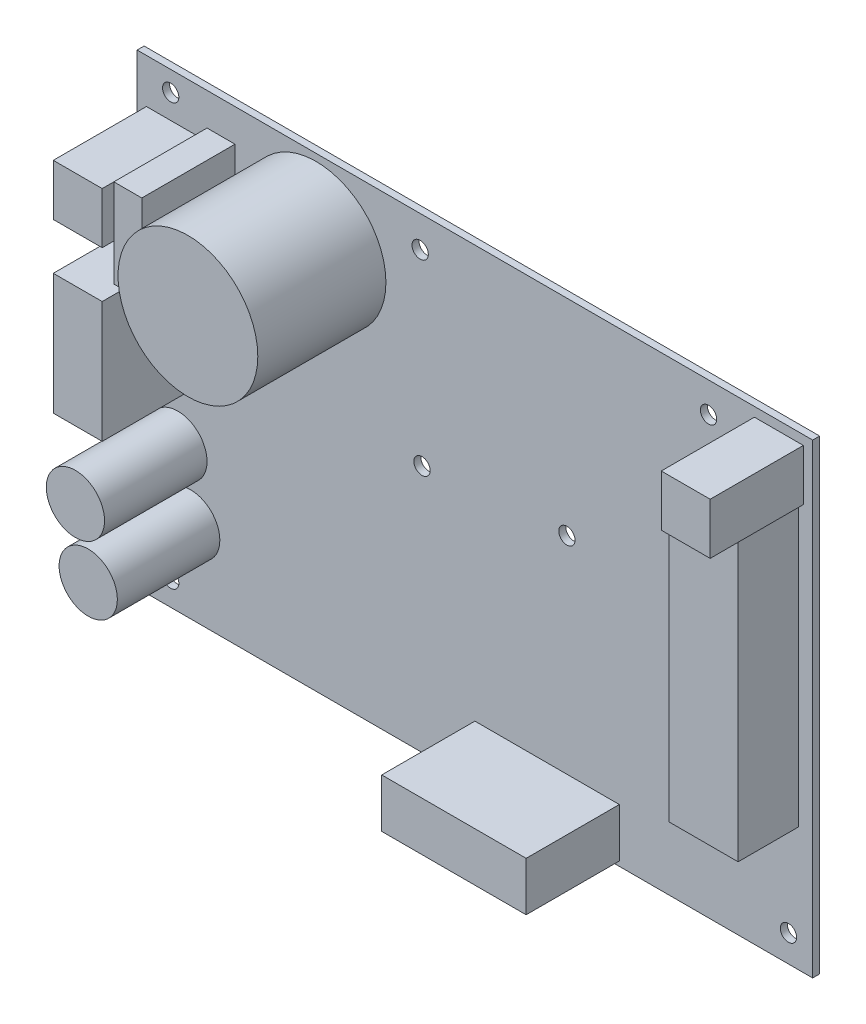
ISO-10303-21;
HEADER;
FILE_DESCRIPTION(('STEP AP214'),'2;1');
FILE_NAME('part.step','',(''),(''),'','','');
FILE_SCHEMA(('AUTOMOTIVE_DESIGN { 1 0 10303 214 1 1 1 1 }'));
ENDSEC;
DATA;
#1=APPLICATION_CONTEXT('core data for automotive mechanical design processes');
#2=APPLICATION_PROTOCOL_DEFINITION('international standard','automotive_design',2000,#1);
#3=PRODUCT_CONTEXT('',#1,'mechanical');
#4=PRODUCT('Part','Part','',(#3));
#5=PRODUCT_RELATED_PRODUCT_CATEGORY('part','',(#4));
#6=PRODUCT_DEFINITION_FORMATION('','',#4);
#7=PRODUCT_DEFINITION_CONTEXT('part definition',#1,'design');
#8=PRODUCT_DEFINITION('design','',#6,#7);
#9=PRODUCT_DEFINITION_SHAPE('','',#8);
#10=(LENGTH_UNIT() NAMED_UNIT(*) SI_UNIT(.MILLI.,.METRE.));
#11=(NAMED_UNIT(*) PLANE_ANGLE_UNIT() SI_UNIT($,.RADIAN.));
#12=(NAMED_UNIT(*) SI_UNIT($,.STERADIAN.) SOLID_ANGLE_UNIT());
#13=UNCERTAINTY_MEASURE_WITH_UNIT(LENGTH_MEASURE(1.E-05),#10,'distance_accuracy_value','');
#14=(GEOMETRIC_REPRESENTATION_CONTEXT(3) GLOBAL_UNCERTAINTY_ASSIGNED_CONTEXT((#13)) GLOBAL_UNIT_ASSIGNED_CONTEXT((#10,
#11,#12)) REPRESENTATION_CONTEXT('',''));
#15=CARTESIAN_POINT('',(0.,0.,0.));
#16=DIRECTION('',(0.,0.,1.));
#17=DIRECTION('',(1.,0.,0.));
#18=AXIS2_PLACEMENT_3D('',#15,#16,#17);
#19=CARTESIAN_POINT('',(-31.5892523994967,-18.7964158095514,23.5));
#20=DIRECTION('',(0.,0.,-1.));
#21=DIRECTION('',(-1.,0.,0.));
#22=AXIS2_PLACEMENT_3D('',#19,#20,#21);
#23=CYLINDRICAL_SURFACE('',#22,6.25);
#24=CARTESIAN_POINT('',(-31.5892523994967,-18.7964158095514,23.5));
#25=DIRECTION('',(0.,0.,1.));
#26=DIRECTION('',(1.,0.,0.));
#27=AXIS2_PLACEMENT_3D('',#24,#25,#26);
#28=CIRCLE('',#27,6.25);
#29=CARTESIAN_POINT('',(-25.3392523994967,-18.7964158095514,23.5));
#30=VERTEX_POINT('',#29);
#31=EDGE_CURVE('E13',#30,#30,#28,.T.);
#32=ORIENTED_EDGE('',*,*,#31,.F.);
#33=EDGE_LOOP('',(#32));
#34=FACE_BOUND('',#33,.T.);
#35=CARTESIAN_POINT('',(-31.5892523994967,-18.7964158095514,1.5));
#36=DIRECTION('',(0.,0.,1.));
#37=DIRECTION('',(1.,0.,0.));
#38=AXIS2_PLACEMENT_3D('',#35,#36,#37);
#39=CIRCLE('',#38,6.25);
#40=CARTESIAN_POINT('',(-25.3392523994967,-18.7964158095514,1.5));
#41=VERTEX_POINT('',#40);
#42=EDGE_CURVE('E61',#41,#41,#39,.T.);
#43=ORIENTED_EDGE('',*,*,#42,.T.);
#44=EDGE_LOOP('',(#43));
#45=FACE_BOUND('',#44,.T.);
#46=ADVANCED_FACE('F58',(#34,#45),#23,.T.);
#47=CARTESIAN_POINT('',(-31.5892523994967,-18.7964158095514,23.5));
#48=DIRECTION('',(0.,0.,1.));
#49=DIRECTION('',(1.,0.,0.));
#50=AXIS2_PLACEMENT_3D('',#47,#48,#49);
#51=PLANE('',#50);
#52=ORIENTED_EDGE('',*,*,#31,.T.);
#53=EDGE_LOOP('',(#52));
#54=FACE_BOUND('',#53,.T.);
#55=ADVANCED_FACE('F73',(#54),#51,.T.);
#56=CARTESIAN_POINT('',(-31.5892523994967,-18.7964158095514,1.5));
#57=DIRECTION('',(0.,0.,1.));
#58=DIRECTION('',(1.,0.,0.));
#59=AXIS2_PLACEMENT_3D('',#56,#57,#58);
#60=PLANE('',#59);
#61=ORIENTED_EDGE('',*,*,#42,.F.);
#62=EDGE_LOOP('',(#61));
#63=FACE_BOUND('',#62,.T.);
#64=ADVANCED_FACE('F71',(#63),#60,.F.);
#65=CLOSED_SHELL('',(#46,#55,#64));
#66=MANIFOLD_SOLID_BREP('B2',#65);
#67=CARTESIAN_POINT('',(-34.3392523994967,-5.5464158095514,23.5));
#68=DIRECTION('',(0.,0.,-1.));
#69=DIRECTION('',(-1.,0.,0.));
#70=AXIS2_PLACEMENT_3D('',#67,#68,#69);
#71=CYLINDRICAL_SURFACE('',#70,6.25);
#72=CARTESIAN_POINT('',(-34.3392523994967,-5.5464158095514,23.5));
#73=DIRECTION('',(0.,0.,1.));
#74=DIRECTION('',(1.,0.,0.));
#75=AXIS2_PLACEMENT_3D('',#72,#73,#74);
#76=CIRCLE('',#75,6.25);
#77=CARTESIAN_POINT('',(-28.0892523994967,-5.5464158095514,23.5));
#78=VERTEX_POINT('',#77);
#79=EDGE_CURVE('E57',#78,#78,#76,.T.);
#80=ORIENTED_EDGE('',*,*,#79,.F.);
#81=EDGE_LOOP('',(#80));
#82=FACE_BOUND('',#81,.T.);
#83=CARTESIAN_POINT('',(-34.3392523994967,-5.5464158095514,1.5));
#84=DIRECTION('',(0.,0.,1.));
#85=DIRECTION('',(1.,0.,0.));
#86=AXIS2_PLACEMENT_3D('',#83,#84,#85);
#87=CIRCLE('',#86,6.25);
#88=CARTESIAN_POINT('',(-28.0892523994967,-5.5464158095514,1.5));
#89=VERTEX_POINT('',#88);
#90=EDGE_CURVE('E113',#89,#89,#87,.T.);
#91=ORIENTED_EDGE('',*,*,#90,.T.);
#92=EDGE_LOOP('',(#91));
#93=FACE_BOUND('',#92,.T.);
#94=ADVANCED_FACE('F110',(#82,#93),#71,.T.);
#95=CARTESIAN_POINT('',(-34.3392523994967,-5.5464158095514,23.5));
#96=DIRECTION('',(0.,0.,1.));
#97=DIRECTION('',(1.,0.,0.));
#98=AXIS2_PLACEMENT_3D('',#95,#96,#97);
#99=PLANE('',#98);
#100=ORIENTED_EDGE('',*,*,#79,.T.);
#101=EDGE_LOOP('',(#100));
#102=FACE_BOUND('',#101,.T.);
#103=ADVANCED_FACE('F125',(#102),#99,.T.);
#104=CARTESIAN_POINT('',(-34.3392523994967,-5.5464158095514,1.5));
#105=DIRECTION('',(0.,0.,1.));
#106=DIRECTION('',(1.,0.,0.));
#107=AXIS2_PLACEMENT_3D('',#104,#105,#106);
#108=PLANE('',#107);
#109=ORIENTED_EDGE('',*,*,#90,.F.);
#110=EDGE_LOOP('',(#109));
#111=FACE_BOUND('',#110,.T.);
#112=ADVANCED_FACE('F123',(#111),#108,.F.);
#113=CLOSED_SHELL('',(#94,#103,#112));
#114=MANIFOLD_SOLID_BREP('B8',#113);
#115=CARTESIAN_POINT('',(0.,0.,1.5));
#116=DIRECTION('',(0.,0.,1.));
#117=DIRECTION('',(1.,0.,0.));
#118=AXIS2_PLACEMENT_3D('',#115,#116,#117);
#119=PLANE('',#118);
#120=CARTESIAN_POINT('',(-4.6892523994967,46.9535841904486,1.5));
#121=DIRECTION('',(0.,0.,1.));
#122=DIRECTION('',(1.,0.,0.));
#123=AXIS2_PLACEMENT_3D('',#120,#121,#122);
#124=CIRCLE('',#123,15.);
#125=CARTESIAN_POINT('',(10.3107476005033,46.9535841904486,1.5));
#126=VERTEX_POINT('',#125);
#127=EDGE_CURVE('E368',#126,#126,#124,.T.);
#128=ORIENTED_EDGE('',*,*,#127,.F.);
#129=EDGE_LOOP('',(#128));
#130=FACE_BOUND('',#129,.T.);
#131=DIRECTION('',(1.,0.,0.));
#132=VECTOR('',#131,1.);
#133=CARTESIAN_POINT('',(29.4107476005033,-35.5464158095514,1.5));
#134=LINE('',#133,#132);
#135=CARTESIAN_POINT('',(29.4107476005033,-35.5464158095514,1.5));
#136=VERTEX_POINT('',#135);
#137=CARTESIAN_POINT('',(60.4107476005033,-35.5464158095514,1.5));
#138=VERTEX_POINT('',#137);
#139=EDGE_CURVE('E419',#136,#138,#134,.T.);
#140=ORIENTED_EDGE('',*,*,#139,.F.);
#141=DIRECTION('',(0.,-1.,0.));
#142=VECTOR('',#141,1.);
#143=CARTESIAN_POINT('',(29.4107476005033,-25.0464158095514,1.5));
#144=LINE('',#143,#142);
#145=CARTESIAN_POINT('',(29.4107476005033,-25.0464158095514,1.5));
#146=VERTEX_POINT('',#145);
#147=EDGE_CURVE('E405',#146,#136,#144,.T.);
#148=ORIENTED_EDGE('',*,*,#147,.F.);
#149=DIRECTION('',(-1.,0.,0.));
#150=VECTOR('',#149,1.);
#151=CARTESIAN_POINT('',(29.4107476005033,-25.0464158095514,1.5));
#152=LINE('',#151,#150);
#153=CARTESIAN_POINT('',(60.4107476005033,-25.0464158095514,1.5));
#154=VERTEX_POINT('',#153);
#155=EDGE_CURVE('E410',#154,#146,#152,.T.);
#156=ORIENTED_EDGE('',*,*,#155,.F.);
#157=DIRECTION('',(0.,1.,0.));
#158=VECTOR('',#157,1.);
#159=CARTESIAN_POINT('',(60.4107476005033,-25.0464158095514,1.5));
#160=LINE('',#159,#158);
#161=EDGE_CURVE('E421',#138,#154,#160,.T.);
#162=ORIENTED_EDGE('',*,*,#161,.F.);
#163=EDGE_LOOP('',(#140,#148,#156,#162));
#164=FACE_BOUND('',#163,.T.);
#165=DIRECTION('',(1.,0.,0.));
#166=VECTOR('',#165,1.);
#167=CARTESIAN_POINT('',(-41.0892523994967,6.9535841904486,1.5));
#168=LINE('',#167,#166);
#169=CARTESIAN_POINT('',(-41.0892523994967,6.9535841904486,1.5));
#170=VERTEX_POINT('',#169);
#171=CARTESIAN_POINT('',(-30.5892523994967,6.9535841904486,1.5));
#172=VERTEX_POINT('',#171);
#173=EDGE_CURVE('E477',#170,#172,#168,.T.);
#174=ORIENTED_EDGE('',*,*,#173,.F.);
#175=DIRECTION('',(0.,-1.,0.));
#176=VECTOR('',#175,1.);
#177=CARTESIAN_POINT('',(-41.0892523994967,32.9535841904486,1.5));
#178=LINE('',#177,#176);
#179=CARTESIAN_POINT('',(-41.0892523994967,32.9535841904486,1.5));
#180=VERTEX_POINT('',#179);
#181=EDGE_CURVE('E463',#180,#170,#178,.T.);
#182=ORIENTED_EDGE('',*,*,#181,.F.);
#183=DIRECTION('',(-1.,0.,0.));
#184=VECTOR('',#183,1.);
#185=CARTESIAN_POINT('',(-41.0892523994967,32.9535841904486,1.5));
#186=LINE('',#185,#184);
#187=CARTESIAN_POINT('',(-30.5892523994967,32.9535841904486,1.5));
#188=VERTEX_POINT('',#187);
#189=EDGE_CURVE('E468',#188,#180,#186,.T.);
#190=ORIENTED_EDGE('',*,*,#189,.F.);
#191=DIRECTION('',(0.,1.,0.));
#192=VECTOR('',#191,1.);
#193=CARTESIAN_POINT('',(-30.5892523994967,32.9535841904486,1.5));
#194=LINE('',#193,#192);
#195=EDGE_CURVE('E479',#172,#188,#194,.T.);
#196=ORIENTED_EDGE('',*,*,#195,.F.);
#197=EDGE_LOOP('',(#174,#182,#190,#196));
#198=FACE_BOUND('',#197,.T.);
#199=CARTESIAN_POINT('',(17.6607476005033,56.7035841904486,1.5));
#200=DIRECTION('',(0.,0.,1.));
#201=DIRECTION('',(1.,0.,0.));
#202=AXIS2_PLACEMENT_3D('',#199,#200,#201);
#203=CIRCLE('',#202,1.75);
#204=CARTESIAN_POINT('',(19.4107476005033,56.7035841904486,1.5));
#205=VERTEX_POINT('',#204);
#206=EDGE_CURVE('E522',#205,#205,#203,.T.);
#207=ORIENTED_EDGE('',*,*,#206,.F.);
#208=EDGE_LOOP('',(#207));
#209=FACE_BOUND('',#208,.T.);
#210=CARTESIAN_POINT('',(49.1607476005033,19.3035841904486,1.5));
#211=DIRECTION('',(0.,0.,1.));
#212=DIRECTION('',(1.,0.,0.));
#213=AXIS2_PLACEMENT_3D('',#210,#211,#212);
#214=CIRCLE('',#213,1.75);
#215=CARTESIAN_POINT('',(50.9107476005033,19.3035841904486,1.5));
#216=VERTEX_POINT('',#215);
#217=EDGE_CURVE('E534',#216,#216,#214,.T.);
#218=ORIENTED_EDGE('',*,*,#217,.F.);
#219=EDGE_LOOP('',(#218));
#220=FACE_BOUND('',#219,.T.);
#221=CARTESIAN_POINT('',(78.6607476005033,43.0035841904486,1.5));
#222=DIRECTION('',(0.,0.,1.));
#223=DIRECTION('',(1.,0.,0.));
#224=AXIS2_PLACEMENT_3D('',#221,#222,#223);
#225=CIRCLE('',#224,1.75);
#226=CARTESIAN_POINT('',(80.4107476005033,43.0035841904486,1.5));
#227=VERTEX_POINT('',#226);
#228=EDGE_CURVE('E546',#227,#227,#225,.T.);
#229=ORIENTED_EDGE('',*,*,#228,.F.);
#230=EDGE_LOOP('',(#229));
#231=FACE_BOUND('',#230,.T.);
#232=CARTESIAN_POINT('',(-35.8892523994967,-31.2464158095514,1.5));
#233=DIRECTION('',(0.,0.,1.));
#234=DIRECTION('',(1.,0.,0.));
#235=AXIS2_PLACEMENT_3D('',#232,#233,#234);
#236=CIRCLE('',#235,1.75);
#237=CARTESIAN_POINT('',(-34.1392523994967,-31.2464158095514,1.5));
#238=VERTEX_POINT('',#237);
#239=EDGE_CURVE('E558',#238,#238,#236,.T.);
#240=ORIENTED_EDGE('',*,*,#239,.F.);
#241=EDGE_LOOP('',(#240));
#242=FACE_BOUND('',#241,.T.);
#243=DIRECTION('',(0.,-1.,0.));
#244=VECTOR('',#243,1.);
#245=CARTESIAN_POINT('',(-43.0892523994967,63.4535841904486,1.5));
#246=LINE('',#245,#244);
#247=CARTESIAN_POINT('',(-43.0892523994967,63.4535841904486,1.5));
#248=VERTEX_POINT('',#247);
#249=CARTESIAN_POINT('',(-43.0892523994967,-36.5464158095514,1.5));
#250=VERTEX_POINT('',#249);
#251=EDGE_CURVE('E570',#248,#250,#246,.T.);
#252=ORIENTED_EDGE('',*,*,#251,.T.);
#253=DIRECTION('',(1.,0.,0.));
#254=VECTOR('',#253,1.);
#255=CARTESIAN_POINT('',(-43.0892523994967,-36.5464158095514,1.5));
#256=LINE('',#255,#254);
#257=CARTESIAN_POINT('',(101.910747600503,-36.5464158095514,1.5));
#258=VERTEX_POINT('',#257);
#259=EDGE_CURVE('E573',#250,#258,#256,.T.);
#260=ORIENTED_EDGE('',*,*,#259,.T.);
#261=DIRECTION('',(0.,1.,0.));
#262=VECTOR('',#261,1.);
#263=CARTESIAN_POINT('',(101.910747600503,63.4535841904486,1.5));
#264=LINE('',#263,#262);
#265=CARTESIAN_POINT('',(101.910747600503,63.4535841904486,1.5));
#266=VERTEX_POINT('',#265);
#267=EDGE_CURVE('E576',#258,#266,#264,.T.);
#268=ORIENTED_EDGE('',*,*,#267,.T.);
#269=DIRECTION('',(-1.,0.,0.));
#270=VECTOR('',#269,1.);
#271=CARTESIAN_POINT('',(-43.0892523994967,63.4535841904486,1.5));
#272=LINE('',#271,#270);
#273=EDGE_CURVE('E578',#266,#248,#272,.T.);
#274=ORIENTED_EDGE('',*,*,#273,.T.);
#275=EDGE_LOOP('',(#252,#260,#268,#274));
#276=FACE_BOUND('',#275,.T.);
#277=CARTESIAN_POINT('',(-35.8892523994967,59.1535841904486,1.5));
#278=DIRECTION('',(0.,0.,1.));
#279=DIRECTION('',(1.,0.,0.));
#280=AXIS2_PLACEMENT_3D('',#277,#278,#279);
#281=CIRCLE('',#280,1.75);
#282=CARTESIAN_POINT('',(-34.1392523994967,59.1535841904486,1.5));
#283=VERTEX_POINT('',#282);
#284=EDGE_CURVE('E564',#283,#283,#281,.T.);
#285=ORIENTED_EDGE('',*,*,#284,.F.);
#286=EDGE_LOOP('',(#285));
#287=FACE_BOUND('',#286,.T.);
#288=CARTESIAN_POINT('',(96.7107476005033,-30.7464158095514,1.5));
#289=DIRECTION('',(0.,0.,1.));
#290=DIRECTION('',(1.,0.,0.));
#291=AXIS2_PLACEMENT_3D('',#288,#289,#290);
#292=CIRCLE('',#291,1.75);
#293=CARTESIAN_POINT('',(98.4607476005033,-30.7464158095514,1.5));
#294=VERTEX_POINT('',#293);
#295=EDGE_CURVE('E552',#294,#294,#292,.T.);
#296=ORIENTED_EDGE('',*,*,#295,.F.);
#297=EDGE_LOOP('',(#296));
#298=FACE_BOUND('',#297,.T.);
#299=CARTESIAN_POINT('',(79.5607476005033,57.0035841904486,1.5));
#300=DIRECTION('',(0.,0.,1.));
#301=DIRECTION('',(1.,0.,0.));
#302=AXIS2_PLACEMENT_3D('',#299,#300,#301);
#303=CIRCLE('',#302,1.75);
#304=CARTESIAN_POINT('',(81.3107476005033,57.0035841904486,1.5));
#305=VERTEX_POINT('',#304);
#306=EDGE_CURVE('E540',#305,#305,#303,.T.);
#307=ORIENTED_EDGE('',*,*,#306,.F.);
#308=EDGE_LOOP('',(#307));
#309=FACE_BOUND('',#308,.T.);
#310=CARTESIAN_POINT('',(18.0607476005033,16.7035841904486,1.5));
#311=DIRECTION('',(0.,0.,1.));
#312=DIRECTION('',(1.,0.,0.));
#313=AXIS2_PLACEMENT_3D('',#310,#311,#312);
#314=CIRCLE('',#313,1.75);
#315=CARTESIAN_POINT('',(19.8107476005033,16.7035841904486,1.5));
#316=VERTEX_POINT('',#315);
#317=EDGE_CURVE('E528',#316,#316,#314,.T.);
#318=ORIENTED_EDGE('',*,*,#317,.F.);
#319=EDGE_LOOP('',(#318));
#320=FACE_BOUND('',#319,.T.);
#321=DIRECTION('',(1.,0.,0.));
#322=VECTOR('',#321,1.);
#323=CARTESIAN_POINT('',(-41.0892523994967,42.9535841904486,1.5));
#324=LINE('',#323,#322);
#325=CARTESIAN_POINT('',(-41.0892523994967,42.9535841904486,1.5));
#326=VERTEX_POINT('',#325);
#327=CARTESIAN_POINT('',(-30.5892523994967,42.9535841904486,1.5));
#328=VERTEX_POINT('',#327);
#329=EDGE_CURVE('E506',#326,#328,#324,.T.);
#330=ORIENTED_EDGE('',*,*,#329,.F.);
#331=DIRECTION('',(0.,-1.,0.));
#332=VECTOR('',#331,1.);
#333=CARTESIAN_POINT('',(-41.0892523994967,53.9535841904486,1.5));
#334=LINE('',#333,#332);
#335=CARTESIAN_POINT('',(-41.0892523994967,53.9535841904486,1.5));
#336=VERTEX_POINT('',#335);
#337=EDGE_CURVE('E492',#336,#326,#334,.T.);
#338=ORIENTED_EDGE('',*,*,#337,.F.);
#339=DIRECTION('',(-1.,0.,0.));
#340=VECTOR('',#339,1.);
#341=CARTESIAN_POINT('',(-41.0892523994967,53.9535841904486,1.5));
#342=LINE('',#341,#340);
#343=CARTESIAN_POINT('',(-30.5892523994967,53.9535841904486,1.5));
#344=VERTEX_POINT('',#343);
#345=EDGE_CURVE('E497',#344,#336,#342,.T.);
#346=ORIENTED_EDGE('',*,*,#345,.F.);
#347=DIRECTION('',(0.,1.,0.));
#348=VECTOR('',#347,1.);
#349=CARTESIAN_POINT('',(-30.5892523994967,53.9535841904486,1.5));
#350=LINE('',#349,#348);
#351=EDGE_CURVE('E508',#328,#344,#350,.T.);
#352=ORIENTED_EDGE('',*,*,#351,.F.);
#353=EDGE_LOOP('',(#330,#338,#346,#352));
#354=FACE_BOUND('',#353,.T.);
#355=DIRECTION('',(1.,0.,0.));
#356=VECTOR('',#355,1.);
#357=CARTESIAN_POINT('',(89.4107476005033,50.4535841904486,1.5));
#358=LINE('',#357,#356);
#359=CARTESIAN_POINT('',(89.4107476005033,50.4535841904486,1.5));
#360=VERTEX_POINT('',#359);
#361=CARTESIAN_POINT('',(99.9107476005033,50.4535841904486,1.5));
#362=VERTEX_POINT('',#361);
#363=EDGE_CURVE('E448',#360,#362,#358,.T.);
#364=ORIENTED_EDGE('',*,*,#363,.F.);
#365=DIRECTION('',(0.,-1.,0.));
#366=VECTOR('',#365,1.);
#367=CARTESIAN_POINT('',(89.4107476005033,61.4535841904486,1.5));
#368=LINE('',#367,#366);
#369=CARTESIAN_POINT('',(89.4107476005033,61.4535841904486,1.5));
#370=VERTEX_POINT('',#369);
#371=EDGE_CURVE('E434',#370,#360,#368,.T.);
#372=ORIENTED_EDGE('',*,*,#371,.F.);
#373=DIRECTION('',(-1.,0.,0.));
#374=VECTOR('',#373,1.);
#375=CARTESIAN_POINT('',(89.4107476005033,61.4535841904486,1.5));
#376=LINE('',#375,#374);
#377=CARTESIAN_POINT('',(99.9107476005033,61.4535841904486,1.5));
#378=VERTEX_POINT('',#377);
#379=EDGE_CURVE('E439',#378,#370,#376,.T.);
#380=ORIENTED_EDGE('',*,*,#379,.F.);
#381=DIRECTION('',(0.,1.,0.));
#382=VECTOR('',#381,1.);
#383=CARTESIAN_POINT('',(99.9107476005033,61.4535841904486,1.5));
#384=LINE('',#383,#382);
#385=EDGE_CURVE('E450',#362,#378,#384,.T.);
#386=ORIENTED_EDGE('',*,*,#385,.F.);
#387=EDGE_LOOP('',(#364,#372,#380,#386));
#388=FACE_BOUND('',#387,.T.);
#389=DIRECTION('',(1.,0.,0.));
#390=VECTOR('',#389,1.);
#391=CARTESIAN_POINT('',(-28.0892523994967,37.4535841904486,1.5));
#392=LINE('',#391,#390);
#393=CARTESIAN_POINT('',(-28.0892523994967,37.4535841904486,1.5));
#394=VERTEX_POINT('',#393);
#395=CARTESIAN_POINT('',(-22.0892523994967,37.4535841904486,1.5));
#396=VERTEX_POINT('',#395);
#397=EDGE_CURVE('E392',#394,#396,#392,.T.);
#398=ORIENTED_EDGE('',*,*,#397,.F.);
#399=DIRECTION('',(0.,-1.,0.));
#400=VECTOR('',#399,1.);
#401=CARTESIAN_POINT('',(-28.0892523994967,56.4535841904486,1.5));
#402=LINE('',#401,#400);
#403=CARTESIAN_POINT('',(-28.0892523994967,56.4535841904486,1.5));
#404=VERTEX_POINT('',#403);
#405=EDGE_CURVE('E377',#404,#394,#402,.T.);
#406=ORIENTED_EDGE('',*,*,#405,.F.);
#407=DIRECTION('',(-1.,0.,0.));
#408=VECTOR('',#407,1.);
#409=CARTESIAN_POINT('',(-28.0892523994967,56.4535841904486,1.5));
#410=LINE('',#409,#408);
#411=CARTESIAN_POINT('',(-22.0892523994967,56.4535841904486,1.5));
#412=VERTEX_POINT('',#411);
#413=EDGE_CURVE('E383',#412,#404,#410,.T.);
#414=ORIENTED_EDGE('',*,*,#413,.F.);
#415=DIRECTION('',(0.,1.,0.));
#416=VECTOR('',#415,1.);
#417=CARTESIAN_POINT('',(-22.0892523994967,56.4535841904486,1.5));
#418=LINE('',#417,#416);
#419=EDGE_CURVE('E394',#396,#412,#418,.T.);
#420=ORIENTED_EDGE('',*,*,#419,.F.);
#421=EDGE_LOOP('',(#398,#406,#414,#420));
#422=FACE_BOUND('',#421,.T.);
#423=DIRECTION('',(1.,0.,0.));
#424=VECTOR('',#423,1.);
#425=CARTESIAN_POINT('',(84.1107476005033,-9.9464158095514,1.5));
#426=LINE('',#425,#424);
#427=CARTESIAN_POINT('',(84.1107476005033,-9.9464158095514,1.5));
#428=VERTEX_POINT('',#427);
#429=CARTESIAN_POINT('',(98.9107476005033,-9.94641580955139,1.5));
#430=VERTEX_POINT('',#429);
#431=EDGE_CURVE('E670',#428,#430,#426,.T.);
#432=ORIENTED_EDGE('',*,*,#431,.F.);
#433=DIRECTION('',(0.,-1.,0.));
#434=VECTOR('',#433,1.);
#435=CARTESIAN_POINT('',(84.1107476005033,50.0535841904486,1.5));
#436=LINE('',#435,#434);
#437=CARTESIAN_POINT('',(84.1107476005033,50.0535841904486,1.5));
#438=VERTEX_POINT('',#437);
#439=EDGE_CURVE('E366',#438,#428,#436,.T.);
#440=ORIENTED_EDGE('',*,*,#439,.F.);
#441=DIRECTION('',(-1.,0.,0.));
#442=VECTOR('',#441,1.);
#443=CARTESIAN_POINT('',(84.1107476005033,50.0535841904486,1.5));
#444=LINE('',#443,#442);
#445=CARTESIAN_POINT('',(98.9107476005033,50.0535841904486,1.5));
#446=VERTEX_POINT('',#445);
#447=EDGE_CURVE('E362',#446,#438,#444,.T.);
#448=ORIENTED_EDGE('',*,*,#447,.F.);
#449=DIRECTION('',(0.,1.,0.));
#450=VECTOR('',#449,1.);
#451=CARTESIAN_POINT('',(98.9107476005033,50.0535841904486,1.5));
#452=LINE('',#451,#450);
#453=EDGE_CURVE('E672',#430,#446,#452,.T.);
#454=ORIENTED_EDGE('',*,*,#453,.F.);
#455=EDGE_LOOP('',(#432,#440,#448,#454));
#456=FACE_BOUND('',#455,.T.);
#457=ADVANCED_FACE('F157',(#130,#164,#198,#209,#220,#231,#242,#276,#287,#298,#309,#320,#354,
#388,#422,#456),#119,.T.);
#458=CARTESIAN_POINT('',(0.,0.,0.));
#459=DIRECTION('',(0.,0.,1.));
#460=DIRECTION('',(1.,0.,0.));
#461=AXIS2_PLACEMENT_3D('',#458,#459,#460);
#462=PLANE('',#461);
#463=CARTESIAN_POINT('',(18.0607476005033,16.7035841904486,0.));
#464=DIRECTION('',(0.,0.,1.));
#465=DIRECTION('',(1.,0.,0.));
#466=AXIS2_PLACEMENT_3D('',#463,#464,#465);
#467=CIRCLE('',#466,1.75);
#468=CARTESIAN_POINT('',(19.8107476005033,16.7035841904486,0.));
#469=VERTEX_POINT('',#468);
#470=EDGE_CURVE('E525',#469,#469,#467,.T.);
#471=ORIENTED_EDGE('',*,*,#470,.T.);
#472=EDGE_LOOP('',(#471));
#473=FACE_BOUND('',#472,.T.);
#474=CARTESIAN_POINT('',(79.5607476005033,57.0035841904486,0.));
#475=DIRECTION('',(0.,0.,1.));
#476=DIRECTION('',(1.,0.,0.));
#477=AXIS2_PLACEMENT_3D('',#474,#475,#476);
#478=CIRCLE('',#477,1.75);
#479=CARTESIAN_POINT('',(81.3107476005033,57.0035841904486,0.));
#480=VERTEX_POINT('',#479);
#481=EDGE_CURVE('E537',#480,#480,#478,.T.);
#482=ORIENTED_EDGE('',*,*,#481,.T.);
#483=EDGE_LOOP('',(#482));
#484=FACE_BOUND('',#483,.T.);
#485=CARTESIAN_POINT('',(96.7107476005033,-30.7464158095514,0.));
#486=DIRECTION('',(0.,0.,1.));
#487=DIRECTION('',(1.,0.,0.));
#488=AXIS2_PLACEMENT_3D('',#485,#486,#487);
#489=CIRCLE('',#488,1.75);
#490=CARTESIAN_POINT('',(98.4607476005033,-30.7464158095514,0.));
#491=VERTEX_POINT('',#490);
#492=EDGE_CURVE('E549',#491,#491,#489,.T.);
#493=ORIENTED_EDGE('',*,*,#492,.T.);
#494=EDGE_LOOP('',(#493));
#495=FACE_BOUND('',#494,.T.);
#496=CARTESIAN_POINT('',(-35.8892523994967,59.1535841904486,0.));
#497=DIRECTION('',(0.,0.,1.));
#498=DIRECTION('',(1.,0.,0.));
#499=AXIS2_PLACEMENT_3D('',#496,#497,#498);
#500=CIRCLE('',#499,1.75);
#501=CARTESIAN_POINT('',(-34.1392523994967,59.1535841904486,0.));
#502=VERTEX_POINT('',#501);
#503=EDGE_CURVE('E561',#502,#502,#500,.T.);
#504=ORIENTED_EDGE('',*,*,#503,.T.);
#505=EDGE_LOOP('',(#504));
#506=FACE_BOUND('',#505,.T.);
#507=DIRECTION('',(0.,-1.,0.));
#508=VECTOR('',#507,1.);
#509=CARTESIAN_POINT('',(-43.0892523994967,63.4535841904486,0.));
#510=LINE('',#509,#508);
#511=CARTESIAN_POINT('',(-43.0892523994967,63.4535841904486,0.));
#512=VERTEX_POINT('',#511);
#513=CARTESIAN_POINT('',(-43.0892523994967,-36.5464158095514,0.));
#514=VERTEX_POINT('',#513);
#515=EDGE_CURVE('E567',#512,#514,#510,.T.);
#516=ORIENTED_EDGE('',*,*,#515,.F.);
#517=DIRECTION('',(-1.,0.,0.));
#518=VECTOR('',#517,1.);
#519=CARTESIAN_POINT('',(-43.0892523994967,63.4535841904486,0.));
#520=LINE('',#519,#518);
#521=CARTESIAN_POINT('',(101.910747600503,63.4535841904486,0.));
#522=VERTEX_POINT('',#521);
#523=EDGE_CURVE('E574',#522,#512,#520,.T.);
#524=ORIENTED_EDGE('',*,*,#523,.F.);
#525=DIRECTION('',(0.,1.,0.));
#526=VECTOR('',#525,1.);
#527=CARTESIAN_POINT('',(101.910747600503,63.4535841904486,0.));
#528=LINE('',#527,#526);
#529=CARTESIAN_POINT('',(101.910747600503,-36.5464158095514,0.));
#530=VERTEX_POINT('',#529);
#531=EDGE_CURVE('E585',#530,#522,#528,.T.);
#532=ORIENTED_EDGE('',*,*,#531,.F.);
#533=DIRECTION('',(1.,0.,0.));
#534=VECTOR('',#533,1.);
#535=CARTESIAN_POINT('',(-43.0892523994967,-36.5464158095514,0.));
#536=LINE('',#535,#534);
#537=EDGE_CURVE('E583',#514,#530,#536,.T.);
#538=ORIENTED_EDGE('',*,*,#537,.F.);
#539=EDGE_LOOP('',(#516,#524,#532,#538));
#540=FACE_BOUND('',#539,.T.);
#541=CARTESIAN_POINT('',(-35.8892523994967,-31.2464158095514,0.));
#542=DIRECTION('',(0.,0.,1.));
#543=DIRECTION('',(1.,0.,0.));
#544=AXIS2_PLACEMENT_3D('',#541,#542,#543);
#545=CIRCLE('',#544,1.75);
#546=CARTESIAN_POINT('',(-34.1392523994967,-31.2464158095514,0.));
#547=VERTEX_POINT('',#546);
#548=EDGE_CURVE('E555',#547,#547,#545,.T.);
#549=ORIENTED_EDGE('',*,*,#548,.T.);
#550=EDGE_LOOP('',(#549));
#551=FACE_BOUND('',#550,.T.);
#552=CARTESIAN_POINT('',(78.6607476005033,43.0035841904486,0.));
#553=DIRECTION('',(0.,0.,1.));
#554=DIRECTION('',(1.,0.,0.));
#555=AXIS2_PLACEMENT_3D('',#552,#553,#554);
#556=CIRCLE('',#555,1.75);
#557=CARTESIAN_POINT('',(80.4107476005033,43.0035841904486,0.));
#558=VERTEX_POINT('',#557);
#559=EDGE_CURVE('E543',#558,#558,#556,.T.);
#560=ORIENTED_EDGE('',*,*,#559,.T.);
#561=EDGE_LOOP('',(#560));
#562=FACE_BOUND('',#561,.T.);
#563=CARTESIAN_POINT('',(49.1607476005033,19.3035841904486,0.));
#564=DIRECTION('',(0.,0.,1.));
#565=DIRECTION('',(1.,0.,0.));
#566=AXIS2_PLACEMENT_3D('',#563,#564,#565);
#567=CIRCLE('',#566,1.75);
#568=CARTESIAN_POINT('',(50.9107476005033,19.3035841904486,0.));
#569=VERTEX_POINT('',#568);
#570=EDGE_CURVE('E531',#569,#569,#567,.T.);
#571=ORIENTED_EDGE('',*,*,#570,.T.);
#572=EDGE_LOOP('',(#571));
#573=FACE_BOUND('',#572,.T.);
#574=CARTESIAN_POINT('',(17.6607476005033,56.7035841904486,0.));
#575=DIRECTION('',(0.,0.,1.));
#576=DIRECTION('',(1.,0.,0.));
#577=AXIS2_PLACEMENT_3D('',#574,#575,#576);
#578=CIRCLE('',#577,1.75);
#579=CARTESIAN_POINT('',(19.4107476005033,56.7035841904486,0.));
#580=VERTEX_POINT('',#579);
#581=EDGE_CURVE('E521',#580,#580,#578,.T.);
#582=ORIENTED_EDGE('',*,*,#581,.T.);
#583=EDGE_LOOP('',(#582));
#584=FACE_BOUND('',#583,.T.);
#585=ADVANCED_FACE('F603',(#473,#484,#495,#506,#540,#551,#562,#573,#584),#462,.F.);
#586=CARTESIAN_POINT('',(-43.0892523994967,63.4535841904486,1.5));
#587=DIRECTION('',(1.,0.,0.));
#588=DIRECTION('',(0.,1.,0.));
#589=AXIS2_PLACEMENT_3D('',#586,#587,#588);
#590=PLANE('',#589);
#591=ORIENTED_EDGE('',*,*,#515,.T.);
#592=DIRECTION('',(0.,0.,-1.));
#593=VECTOR('',#592,1.);
#594=CARTESIAN_POINT('',(-43.0892523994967,-36.5464158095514,1.5));
#595=LINE('',#594,#593);
#596=EDGE_CURVE('E108',#250,#514,#595,.T.);
#597=ORIENTED_EDGE('',*,*,#596,.F.);
#598=ORIENTED_EDGE('',*,*,#251,.F.);
#599=DIRECTION('',(0.,0.,-1.));
#600=VECTOR('',#599,1.);
#601=CARTESIAN_POINT('',(-43.0892523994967,63.4535841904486,1.5));
#602=LINE('',#601,#600);
#603=EDGE_CURVE('E580',#248,#512,#602,.T.);
#604=ORIENTED_EDGE('',*,*,#603,.T.);
#605=EDGE_LOOP('',(#591,#597,#598,#604));
#606=FACE_BOUND('',#605,.T.);
#607=ADVANCED_FACE('F159',(#606),#590,.F.);
#608=CARTESIAN_POINT('',(-43.0892523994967,-36.5464158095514,1.5));
#609=DIRECTION('',(0.,1.,0.));
#610=DIRECTION('',(0.,0.,1.));
#611=AXIS2_PLACEMENT_3D('',#608,#609,#610);
#612=PLANE('',#611);
#613=ORIENTED_EDGE('',*,*,#537,.T.);
#614=DIRECTION('',(0.,0.,-1.));
#615=VECTOR('',#614,1.);
#616=CARTESIAN_POINT('',(101.910747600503,-36.5464158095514,1.5));
#617=LINE('',#616,#615);
#618=EDGE_CURVE('E165',#258,#530,#617,.T.);
#619=ORIENTED_EDGE('',*,*,#618,.F.);
#620=ORIENTED_EDGE('',*,*,#259,.F.);
#621=ORIENTED_EDGE('',*,*,#596,.T.);
#622=EDGE_LOOP('',(#613,#619,#620,#621));
#623=FACE_BOUND('',#622,.T.);
#624=ADVANCED_FACE('F614',(#623),#612,.F.);
#625=CARTESIAN_POINT('',(101.910747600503,63.4535841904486,1.5));
#626=DIRECTION('',(-1.,0.,0.));
#627=DIRECTION('',(0.,0.,1.));
#628=AXIS2_PLACEMENT_3D('',#625,#626,#627);
#629=PLANE('',#628);
#630=ORIENTED_EDGE('',*,*,#531,.T.);
#631=DIRECTION('',(0.,0.,-1.));
#632=VECTOR('',#631,1.);
#633=CARTESIAN_POINT('',(101.910747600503,63.4535841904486,1.5));
#634=LINE('',#633,#632);
#635=EDGE_CURVE('E590',#266,#522,#634,.T.);
#636=ORIENTED_EDGE('',*,*,#635,.F.);
#637=ORIENTED_EDGE('',*,*,#267,.F.);
#638=ORIENTED_EDGE('',*,*,#618,.T.);
#639=EDGE_LOOP('',(#630,#636,#637,#638));
#640=FACE_BOUND('',#639,.T.);
#641=ADVANCED_FACE('F597',(#640),#629,.F.);
#642=CARTESIAN_POINT('',(-43.0892523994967,63.4535841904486,1.5));
#643=DIRECTION('',(0.,-1.,0.));
#644=DIRECTION('',(0.,0.,-1.));
#645=AXIS2_PLACEMENT_3D('',#642,#643,#644);
#646=PLANE('',#645);
#647=ORIENTED_EDGE('',*,*,#523,.T.);
#648=ORIENTED_EDGE('',*,*,#603,.F.);
#649=ORIENTED_EDGE('',*,*,#273,.F.);
#650=ORIENTED_EDGE('',*,*,#635,.T.);
#651=EDGE_LOOP('',(#647,#648,#649,#650));
#652=FACE_BOUND('',#651,.T.);
#653=ADVANCED_FACE('F607',(#652),#646,.F.);
#654=CARTESIAN_POINT('',(-35.8892523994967,59.1535841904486,1.5));
#655=DIRECTION('',(0.,0.,-1.));
#656=DIRECTION('',(-1.,0.,0.));
#657=AXIS2_PLACEMENT_3D('',#654,#655,#656);
#658=CYLINDRICAL_SURFACE('',#657,1.75);
#659=ORIENTED_EDGE('',*,*,#284,.T.);
#660=EDGE_LOOP('',(#659));
#661=FACE_BOUND('',#660,.T.);
#662=ORIENTED_EDGE('',*,*,#503,.F.);
#663=EDGE_LOOP('',(#662));
#664=FACE_BOUND('',#663,.T.);
#665=ADVANCED_FACE('F632',(#661,#664),#658,.F.);
#666=CARTESIAN_POINT('',(-35.8892523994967,-31.2464158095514,1.5));
#667=DIRECTION('',(0.,0.,-1.));
#668=DIRECTION('',(-1.,0.,0.));
#669=AXIS2_PLACEMENT_3D('',#666,#667,#668);
#670=CYLINDRICAL_SURFACE('',#669,1.75);
#671=ORIENTED_EDGE('',*,*,#239,.T.);
#672=EDGE_LOOP('',(#671));
#673=FACE_BOUND('',#672,.T.);
#674=ORIENTED_EDGE('',*,*,#548,.F.);
#675=EDGE_LOOP('',(#674));
#676=FACE_BOUND('',#675,.T.);
#677=ADVANCED_FACE('F639',(#673,#676),#670,.F.);
#678=CARTESIAN_POINT('',(96.7107476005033,-30.7464158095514,1.5));
#679=DIRECTION('',(0.,0.,-1.));
#680=DIRECTION('',(-1.,0.,0.));
#681=AXIS2_PLACEMENT_3D('',#678,#679,#680);
#682=CYLINDRICAL_SURFACE('',#681,1.75);
#683=ORIENTED_EDGE('',*,*,#295,.T.);
#684=EDGE_LOOP('',(#683));
#685=FACE_BOUND('',#684,.T.);
#686=ORIENTED_EDGE('',*,*,#492,.F.);
#687=EDGE_LOOP('',(#686));
#688=FACE_BOUND('',#687,.T.);
#689=ADVANCED_FACE('F644',(#685,#688),#682,.F.);
#690=CARTESIAN_POINT('',(78.6607476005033,43.0035841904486,1.5));
#691=DIRECTION('',(0.,0.,-1.));
#692=DIRECTION('',(-1.,0.,0.));
#693=AXIS2_PLACEMENT_3D('',#690,#691,#692);
#694=CYLINDRICAL_SURFACE('',#693,1.75);
#695=ORIENTED_EDGE('',*,*,#228,.T.);
#696=EDGE_LOOP('',(#695));
#697=FACE_BOUND('',#696,.T.);
#698=ORIENTED_EDGE('',*,*,#559,.F.);
#699=EDGE_LOOP('',(#698));
#700=FACE_BOUND('',#699,.T.);
#701=ADVANCED_FACE('F819',(#697,#700),#694,.F.);
#702=CARTESIAN_POINT('',(79.5607476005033,57.0035841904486,1.5));
#703=DIRECTION('',(0.,0.,-1.));
#704=DIRECTION('',(-1.,0.,0.));
#705=AXIS2_PLACEMENT_3D('',#702,#703,#704);
#706=CYLINDRICAL_SURFACE('',#705,1.75);
#707=ORIENTED_EDGE('',*,*,#306,.T.);
#708=EDGE_LOOP('',(#707));
#709=FACE_BOUND('',#708,.T.);
#710=ORIENTED_EDGE('',*,*,#481,.F.);
#711=EDGE_LOOP('',(#710));
#712=FACE_BOUND('',#711,.T.);
#713=ADVANCED_FACE('F815',(#709,#712),#706,.F.);
#714=CARTESIAN_POINT('',(49.1607476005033,19.3035841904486,1.5));
#715=DIRECTION('',(0.,0.,-1.));
#716=DIRECTION('',(-1.,0.,0.));
#717=AXIS2_PLACEMENT_3D('',#714,#715,#716);
#718=CYLINDRICAL_SURFACE('',#717,1.75);
#719=ORIENTED_EDGE('',*,*,#217,.T.);
#720=EDGE_LOOP('',(#719));
#721=FACE_BOUND('',#720,.T.);
#722=ORIENTED_EDGE('',*,*,#570,.F.);
#723=EDGE_LOOP('',(#722));
#724=FACE_BOUND('',#723,.T.);
#725=ADVANCED_FACE('F811',(#721,#724),#718,.F.);
#726=CARTESIAN_POINT('',(18.0607476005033,16.7035841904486,1.5));
#727=DIRECTION('',(0.,0.,-1.));
#728=DIRECTION('',(-1.,0.,0.));
#729=AXIS2_PLACEMENT_3D('',#726,#727,#728);
#730=CYLINDRICAL_SURFACE('',#729,1.75);
#731=ORIENTED_EDGE('',*,*,#317,.T.);
#732=EDGE_LOOP('',(#731));
#733=FACE_BOUND('',#732,.T.);
#734=ORIENTED_EDGE('',*,*,#470,.F.);
#735=EDGE_LOOP('',(#734));
#736=FACE_BOUND('',#735,.T.);
#737=ADVANCED_FACE('F807',(#733,#736),#730,.F.);
#738=CARTESIAN_POINT('',(17.6607476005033,56.7035841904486,1.5));
#739=DIRECTION('',(0.,0.,-1.));
#740=DIRECTION('',(-1.,0.,0.));
#741=AXIS2_PLACEMENT_3D('',#738,#739,#740);
#742=CYLINDRICAL_SURFACE('',#741,1.75);
#743=ORIENTED_EDGE('',*,*,#206,.T.);
#744=EDGE_LOOP('',(#743));
#745=FACE_BOUND('',#744,.T.);
#746=ORIENTED_EDGE('',*,*,#581,.F.);
#747=EDGE_LOOP('',(#746));
#748=FACE_BOUND('',#747,.T.);
#749=ADVANCED_FACE('F803',(#745,#748),#742,.F.);
#750=CARTESIAN_POINT('',(-41.0892523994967,53.9535841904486,21.5));
#751=DIRECTION('',(1.,0.,0.));
#752=DIRECTION('',(0.,0.,-1.));
#753=AXIS2_PLACEMENT_3D('',#750,#751,#752);
#754=PLANE('',#753);
#755=ORIENTED_EDGE('',*,*,#337,.T.);
#756=DIRECTION('',(0.,0.,-1.));
#757=VECTOR('',#756,1.);
#758=CARTESIAN_POINT('',(-41.0892523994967,42.9535841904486,21.5));
#759=LINE('',#758,#757);
#760=CARTESIAN_POINT('',(-41.0892523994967,42.9535841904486,21.5));
#761=VERTEX_POINT('',#760);
#762=EDGE_CURVE('E519',#761,#326,#759,.T.);
#763=ORIENTED_EDGE('',*,*,#762,.F.);
#764=DIRECTION('',(0.,-1.,0.));
#765=VECTOR('',#764,1.);
#766=CARTESIAN_POINT('',(-41.0892523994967,53.9535841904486,21.5));
#767=LINE('',#766,#765);
#768=CARTESIAN_POINT('',(-41.0892523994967,53.9535841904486,21.5));
#769=VERTEX_POINT('',#768);
#770=EDGE_CURVE('E493',#769,#761,#767,.T.);
#771=ORIENTED_EDGE('',*,*,#770,.F.);
#772=DIRECTION('',(0.,0.,-1.));
#773=VECTOR('',#772,1.);
#774=CARTESIAN_POINT('',(-41.0892523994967,53.9535841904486,21.5));
#775=LINE('',#774,#773);
#776=EDGE_CURVE('E503',#769,#336,#775,.T.);
#777=ORIENTED_EDGE('',*,*,#776,.T.);
#778=EDGE_LOOP('',(#755,#763,#771,#777));
#779=FACE_BOUND('',#778,.T.);
#780=ADVANCED_FACE('F799',(#779),#754,.F.);
#781=CARTESIAN_POINT('',(-41.0892523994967,42.9535841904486,21.5));
#782=DIRECTION('',(0.,1.,0.));
#783=DIRECTION('',(0.,0.,1.));
#784=AXIS2_PLACEMENT_3D('',#781,#782,#783);
#785=PLANE('',#784);
#786=ORIENTED_EDGE('',*,*,#329,.T.);
#787=DIRECTION('',(0.,0.,-1.));
#788=VECTOR('',#787,1.);
#789=CARTESIAN_POINT('',(-30.5892523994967,42.9535841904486,21.5));
#790=LINE('',#789,#788);
#791=CARTESIAN_POINT('',(-30.5892523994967,42.9535841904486,21.5));
#792=VERTEX_POINT('',#791);
#793=EDGE_CURVE('E516',#792,#328,#790,.T.);
#794=ORIENTED_EDGE('',*,*,#793,.F.);
#795=DIRECTION('',(1.,0.,0.));
#796=VECTOR('',#795,1.);
#797=CARTESIAN_POINT('',(-41.0892523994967,42.9535841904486,21.5));
#798=LINE('',#797,#796);
#799=EDGE_CURVE('E496',#761,#792,#798,.T.);
#800=ORIENTED_EDGE('',*,*,#799,.F.);
#801=ORIENTED_EDGE('',*,*,#762,.T.);
#802=EDGE_LOOP('',(#786,#794,#800,#801));
#803=FACE_BOUND('',#802,.T.);
#804=ADVANCED_FACE('F795',(#803),#785,.F.);
#805=CARTESIAN_POINT('',(-30.5892523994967,53.9535841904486,21.5));
#806=DIRECTION('',(-1.,0.,0.));
#807=DIRECTION('',(0.,0.,1.));
#808=AXIS2_PLACEMENT_3D('',#805,#806,#807);
#809=PLANE('',#808);
#810=ORIENTED_EDGE('',*,*,#351,.T.);
#811=DIRECTION('',(0.,0.,-1.));
#812=VECTOR('',#811,1.);
#813=CARTESIAN_POINT('',(-30.5892523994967,53.9535841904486,21.5));
#814=LINE('',#813,#812);
#815=CARTESIAN_POINT('',(-30.5892523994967,53.9535841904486,21.5));
#816=VERTEX_POINT('',#815);
#817=EDGE_CURVE('E514',#816,#344,#814,.T.);
#818=ORIENTED_EDGE('',*,*,#817,.F.);
#819=DIRECTION('',(0.,1.,0.));
#820=VECTOR('',#819,1.);
#821=CARTESIAN_POINT('',(-30.5892523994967,53.9535841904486,21.5));
#822=LINE('',#821,#820);
#823=EDGE_CURVE('E499',#792,#816,#822,.T.);
#824=ORIENTED_EDGE('',*,*,#823,.F.);
#825=ORIENTED_EDGE('',*,*,#793,.T.);
#826=EDGE_LOOP('',(#810,#818,#824,#825));
#827=FACE_BOUND('',#826,.T.);
#828=ADVANCED_FACE('F791',(#827),#809,.F.);
#829=CARTESIAN_POINT('',(-41.0892523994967,53.9535841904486,21.5));
#830=DIRECTION('',(0.,-1.,0.));
#831=DIRECTION('',(0.,0.,-1.));
#832=AXIS2_PLACEMENT_3D('',#829,#830,#831);
#833=PLANE('',#832);
#834=ORIENTED_EDGE('',*,*,#345,.T.);
#835=ORIENTED_EDGE('',*,*,#776,.F.);
#836=DIRECTION('',(-1.,0.,0.));
#837=VECTOR('',#836,1.);
#838=CARTESIAN_POINT('',(-41.0892523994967,53.9535841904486,21.5));
#839=LINE('',#838,#837);
#840=EDGE_CURVE('E501',#816,#769,#839,.T.);
#841=ORIENTED_EDGE('',*,*,#840,.F.);
#842=ORIENTED_EDGE('',*,*,#817,.T.);
#843=EDGE_LOOP('',(#834,#835,#841,#842));
#844=FACE_BOUND('',#843,.T.);
#845=ADVANCED_FACE('F787',(#844),#833,.F.);
#846=CARTESIAN_POINT('',(0.,0.,21.5));
#847=DIRECTION('',(0.,0.,1.));
#848=DIRECTION('',(1.,0.,0.));
#849=AXIS2_PLACEMENT_3D('',#846,#847,#848);
#850=PLANE('',#849);
#851=ORIENTED_EDGE('',*,*,#770,.T.);
#852=ORIENTED_EDGE('',*,*,#799,.T.);
#853=ORIENTED_EDGE('',*,*,#823,.T.);
#854=ORIENTED_EDGE('',*,*,#840,.T.);
#855=EDGE_LOOP('',(#851,#852,#853,#854));
#856=FACE_BOUND('',#855,.T.);
#857=ADVANCED_FACE('F783',(#856),#850,.T.);
#858=CARTESIAN_POINT('',(-41.0892523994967,32.9535841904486,21.5));
#859=DIRECTION('',(1.,0.,0.));
#860=DIRECTION('',(0.,0.,-1.));
#861=AXIS2_PLACEMENT_3D('',#858,#859,#860);
#862=PLANE('',#861);
#863=ORIENTED_EDGE('',*,*,#181,.T.);
#864=DIRECTION('',(0.,0.,-1.));
#865=VECTOR('',#864,1.);
#866=CARTESIAN_POINT('',(-41.0892523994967,6.9535841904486,21.5));
#867=LINE('',#866,#865);
#868=CARTESIAN_POINT('',(-41.0892523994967,6.9535841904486,21.5));
#869=VERTEX_POINT('',#868);
#870=EDGE_CURVE('E490',#869,#170,#867,.T.);
#871=ORIENTED_EDGE('',*,*,#870,.F.);
#872=DIRECTION('',(0.,-1.,0.));
#873=VECTOR('',#872,1.);
#874=CARTESIAN_POINT('',(-41.0892523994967,32.9535841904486,21.5));
#875=LINE('',#874,#873);
#876=CARTESIAN_POINT('',(-41.0892523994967,32.9535841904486,21.5));
#877=VERTEX_POINT('',#876);
#878=EDGE_CURVE('E464',#877,#869,#875,.T.);
#879=ORIENTED_EDGE('',*,*,#878,.F.);
#880=DIRECTION('',(0.,0.,-1.));
#881=VECTOR('',#880,1.);
#882=CARTESIAN_POINT('',(-41.0892523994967,32.9535841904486,21.5));
#883=LINE('',#882,#881);
#884=EDGE_CURVE('E474',#877,#180,#883,.T.);
#885=ORIENTED_EDGE('',*,*,#884,.T.);
#886=EDGE_LOOP('',(#863,#871,#879,#885));
#887=FACE_BOUND('',#886,.T.);
#888=ADVANCED_FACE('F779',(#887),#862,.F.);
#889=CARTESIAN_POINT('',(-41.0892523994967,6.9535841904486,21.5));
#890=DIRECTION('',(0.,1.,0.));
#891=DIRECTION('',(0.,0.,1.));
#892=AXIS2_PLACEMENT_3D('',#889,#890,#891);
#893=PLANE('',#892);
#894=ORIENTED_EDGE('',*,*,#173,.T.);
#895=DIRECTION('',(0.,0.,-1.));
#896=VECTOR('',#895,1.);
#897=CARTESIAN_POINT('',(-30.5892523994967,6.9535841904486,21.5));
#898=LINE('',#897,#896);
#899=CARTESIAN_POINT('',(-30.5892523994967,6.9535841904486,21.5));
#900=VERTEX_POINT('',#899);
#901=EDGE_CURVE('E487',#900,#172,#898,.T.);
#902=ORIENTED_EDGE('',*,*,#901,.F.);
#903=DIRECTION('',(1.,0.,0.));
#904=VECTOR('',#903,1.);
#905=CARTESIAN_POINT('',(-41.0892523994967,6.9535841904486,21.5));
#906=LINE('',#905,#904);
#907=EDGE_CURVE('E467',#869,#900,#906,.T.);
#908=ORIENTED_EDGE('',*,*,#907,.F.);
#909=ORIENTED_EDGE('',*,*,#870,.T.);
#910=EDGE_LOOP('',(#894,#902,#908,#909));
#911=FACE_BOUND('',#910,.T.);
#912=ADVANCED_FACE('F775',(#911),#893,.F.);
#913=CARTESIAN_POINT('',(-30.5892523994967,32.9535841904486,21.5));
#914=DIRECTION('',(-1.,0.,0.));
#915=DIRECTION('',(0.,-1.,0.));
#916=AXIS2_PLACEMENT_3D('',#913,#914,#915);
#917=PLANE('',#916);
#918=ORIENTED_EDGE('',*,*,#195,.T.);
#919=DIRECTION('',(0.,0.,-1.));
#920=VECTOR('',#919,1.);
#921=CARTESIAN_POINT('',(-30.5892523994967,32.9535841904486,21.5));
#922=LINE('',#921,#920);
#923=CARTESIAN_POINT('',(-30.5892523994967,32.9535841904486,21.5));
#924=VERTEX_POINT('',#923);
#925=EDGE_CURVE('E485',#924,#188,#922,.T.);
#926=ORIENTED_EDGE('',*,*,#925,.F.);
#927=DIRECTION('',(0.,1.,0.));
#928=VECTOR('',#927,1.);
#929=CARTESIAN_POINT('',(-30.5892523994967,32.9535841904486,21.5));
#930=LINE('',#929,#928);
#931=EDGE_CURVE('E470',#900,#924,#930,.T.);
#932=ORIENTED_EDGE('',*,*,#931,.F.);
#933=ORIENTED_EDGE('',*,*,#901,.T.);
#934=EDGE_LOOP('',(#918,#926,#932,#933));
#935=FACE_BOUND('',#934,.T.);
#936=ADVANCED_FACE('F771',(#935),#917,.F.);
#937=CARTESIAN_POINT('',(-41.0892523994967,32.9535841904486,21.5));
#938=DIRECTION('',(0.,-1.,0.));
#939=DIRECTION('',(1.,0.,0.));
#940=AXIS2_PLACEMENT_3D('',#937,#938,#939);
#941=PLANE('',#940);
#942=ORIENTED_EDGE('',*,*,#189,.T.);
#943=ORIENTED_EDGE('',*,*,#884,.F.);
#944=DIRECTION('',(-1.,0.,0.));
#945=VECTOR('',#944,1.);
#946=CARTESIAN_POINT('',(-41.0892523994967,32.9535841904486,21.5));
#947=LINE('',#946,#945);
#948=EDGE_CURVE('E472',#924,#877,#947,.T.);
#949=ORIENTED_EDGE('',*,*,#948,.F.);
#950=ORIENTED_EDGE('',*,*,#925,.T.);
#951=EDGE_LOOP('',(#942,#943,#949,#950));
#952=FACE_BOUND('',#951,.T.);
#953=ADVANCED_FACE('F767',(#952),#941,.F.);
#954=CARTESIAN_POINT('',(0.,0.,21.5));
#955=DIRECTION('',(0.,0.,1.));
#956=DIRECTION('',(1.,0.,0.));
#957=AXIS2_PLACEMENT_3D('',#954,#955,#956);
#958=PLANE('',#957);
#959=ORIENTED_EDGE('',*,*,#878,.T.);
#960=ORIENTED_EDGE('',*,*,#907,.T.);
#961=ORIENTED_EDGE('',*,*,#931,.T.);
#962=ORIENTED_EDGE('',*,*,#948,.T.);
#963=EDGE_LOOP('',(#959,#960,#961,#962));
#964=FACE_BOUND('',#963,.T.);
#965=ADVANCED_FACE('F763',(#964),#958,.T.);
#966=CARTESIAN_POINT('',(89.4107476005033,61.4535841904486,21.5));
#967=DIRECTION('',(1.,0.,0.));
#968=DIRECTION('',(0.,1.,0.));
#969=AXIS2_PLACEMENT_3D('',#966,#967,#968);
#970=PLANE('',#969);
#971=ORIENTED_EDGE('',*,*,#371,.T.);
#972=DIRECTION('',(0.,0.,-1.));
#973=VECTOR('',#972,1.);
#974=CARTESIAN_POINT('',(89.4107476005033,50.4535841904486,21.5));
#975=LINE('',#974,#973);
#976=CARTESIAN_POINT('',(89.4107476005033,50.4535841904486,21.5));
#977=VERTEX_POINT('',#976);
#978=EDGE_CURVE('E461',#977,#360,#975,.T.);
#979=ORIENTED_EDGE('',*,*,#978,.F.);
#980=DIRECTION('',(0.,-1.,0.));
#981=VECTOR('',#980,1.);
#982=CARTESIAN_POINT('',(89.4107476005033,61.4535841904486,21.5));
#983=LINE('',#982,#981);
#984=CARTESIAN_POINT('',(89.4107476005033,61.4535841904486,21.5));
#985=VERTEX_POINT('',#984);
#986=EDGE_CURVE('E435',#985,#977,#983,.T.);
#987=ORIENTED_EDGE('',*,*,#986,.F.);
#988=DIRECTION('',(0.,0.,-1.));
#989=VECTOR('',#988,1.);
#990=CARTESIAN_POINT('',(89.4107476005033,61.4535841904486,21.5));
#991=LINE('',#990,#989);
#992=EDGE_CURVE('E445',#985,#370,#991,.T.);
#993=ORIENTED_EDGE('',*,*,#992,.T.);
#994=EDGE_LOOP('',(#971,#979,#987,#993));
#995=FACE_BOUND('',#994,.T.);
#996=ADVANCED_FACE('F759',(#995),#970,.F.);
#997=CARTESIAN_POINT('',(89.4107476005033,50.4535841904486,21.5));
#998=DIRECTION('',(0.,1.,0.));
#999=DIRECTION('',(0.,0.,1.));
#1000=AXIS2_PLACEMENT_3D('',#997,#998,#999);
#1001=PLANE('',#1000);
#1002=ORIENTED_EDGE('',*,*,#363,.T.);
#1003=DIRECTION('',(0.,0.,-1.));
#1004=VECTOR('',#1003,1.);
#1005=CARTESIAN_POINT('',(99.9107476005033,50.4535841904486,21.5));
#1006=LINE('',#1005,#1004);
#1007=CARTESIAN_POINT('',(99.9107476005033,50.4535841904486,21.5));
#1008=VERTEX_POINT('',#1007);
#1009=EDGE_CURVE('E458',#1008,#362,#1006,.T.);
#1010=ORIENTED_EDGE('',*,*,#1009,.F.);
#1011=DIRECTION('',(1.,0.,0.));
#1012=VECTOR('',#1011,1.);
#1013=CARTESIAN_POINT('',(89.4107476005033,50.4535841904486,21.5));
#1014=LINE('',#1013,#1012);
#1015=EDGE_CURVE('E438',#977,#1008,#1014,.T.);
#1016=ORIENTED_EDGE('',*,*,#1015,.F.);
#1017=ORIENTED_EDGE('',*,*,#978,.T.);
#1018=EDGE_LOOP('',(#1002,#1010,#1016,#1017));
#1019=FACE_BOUND('',#1018,.T.);
#1020=ADVANCED_FACE('F755',(#1019),#1001,.F.);
#1021=CARTESIAN_POINT('',(99.9107476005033,61.4535841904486,21.5));
#1022=DIRECTION('',(-1.,0.,0.));
#1023=DIRECTION('',(0.,0.,1.));
#1024=AXIS2_PLACEMENT_3D('',#1021,#1022,#1023);
#1025=PLANE('',#1024);
#1026=ORIENTED_EDGE('',*,*,#385,.T.);
#1027=DIRECTION('',(0.,0.,-1.));
#1028=VECTOR('',#1027,1.);
#1029=CARTESIAN_POINT('',(99.9107476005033,61.4535841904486,21.5));
#1030=LINE('',#1029,#1028);
#1031=CARTESIAN_POINT('',(99.9107476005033,61.4535841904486,21.5));
#1032=VERTEX_POINT('',#1031);
#1033=EDGE_CURVE('E456',#1032,#378,#1030,.T.);
#1034=ORIENTED_EDGE('',*,*,#1033,.F.);
#1035=DIRECTION('',(0.,1.,0.));
#1036=VECTOR('',#1035,1.);
#1037=CARTESIAN_POINT('',(99.9107476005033,61.4535841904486,21.5));
#1038=LINE('',#1037,#1036);
#1039=EDGE_CURVE('E441',#1008,#1032,#1038,.T.);
#1040=ORIENTED_EDGE('',*,*,#1039,.F.);
#1041=ORIENTED_EDGE('',*,*,#1009,.T.);
#1042=EDGE_LOOP('',(#1026,#1034,#1040,#1041));
#1043=FACE_BOUND('',#1042,.T.);
#1044=ADVANCED_FACE('F751',(#1043),#1025,.F.);
#1045=CARTESIAN_POINT('',(89.4107476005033,61.4535841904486,21.5));
#1046=DIRECTION('',(0.,-1.,0.));
#1047=DIRECTION('',(0.,0.,-1.));
#1048=AXIS2_PLACEMENT_3D('',#1045,#1046,#1047);
#1049=PLANE('',#1048);
#1050=ORIENTED_EDGE('',*,*,#379,.T.);
#1051=ORIENTED_EDGE('',*,*,#992,.F.);
#1052=DIRECTION('',(-1.,0.,0.));
#1053=VECTOR('',#1052,1.);
#1054=CARTESIAN_POINT('',(89.4107476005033,61.4535841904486,21.5));
#1055=LINE('',#1054,#1053);
#1056=EDGE_CURVE('E443',#1032,#985,#1055,.T.);
#1057=ORIENTED_EDGE('',*,*,#1056,.F.);
#1058=ORIENTED_EDGE('',*,*,#1033,.T.);
#1059=EDGE_LOOP('',(#1050,#1051,#1057,#1058));
#1060=FACE_BOUND('',#1059,.T.);
#1061=ADVANCED_FACE('F747',(#1060),#1049,.F.);
#1062=CARTESIAN_POINT('',(0.,0.,21.5));
#1063=DIRECTION('',(0.,0.,1.));
#1064=DIRECTION('',(1.,0.,0.));
#1065=AXIS2_PLACEMENT_3D('',#1062,#1063,#1064);
#1066=PLANE('',#1065);
#1067=ORIENTED_EDGE('',*,*,#986,.T.);
#1068=ORIENTED_EDGE('',*,*,#1015,.T.);
#1069=ORIENTED_EDGE('',*,*,#1039,.T.);
#1070=ORIENTED_EDGE('',*,*,#1056,.T.);
#1071=EDGE_LOOP('',(#1067,#1068,#1069,#1070));
#1072=FACE_BOUND('',#1071,.T.);
#1073=ADVANCED_FACE('F743',(#1072),#1066,.T.);
#1074=CARTESIAN_POINT('',(29.4107476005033,-25.0464158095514,21.5));
#1075=DIRECTION('',(1.,0.,0.));
#1076=DIRECTION('',(0.,0.,-1.));
#1077=AXIS2_PLACEMENT_3D('',#1074,#1075,#1076);
#1078=PLANE('',#1077);
#1079=ORIENTED_EDGE('',*,*,#147,.T.);
#1080=DIRECTION('',(0.,0.,-1.));
#1081=VECTOR('',#1080,1.);
#1082=CARTESIAN_POINT('',(29.4107476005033,-35.5464158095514,21.5));
#1083=LINE('',#1082,#1081);
#1084=CARTESIAN_POINT('',(29.4107476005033,-35.5464158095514,21.5));
#1085=VERTEX_POINT('',#1084);
#1086=EDGE_CURVE('E432',#1085,#136,#1083,.T.);
#1087=ORIENTED_EDGE('',*,*,#1086,.F.);
#1088=DIRECTION('',(0.,-1.,0.));
#1089=VECTOR('',#1088,1.);
#1090=CARTESIAN_POINT('',(29.4107476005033,-25.0464158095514,21.5));
#1091=LINE('',#1090,#1089);
#1092=CARTESIAN_POINT('',(29.4107476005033,-25.0464158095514,21.5));
#1093=VERTEX_POINT('',#1092);
#1094=EDGE_CURVE('E406',#1093,#1085,#1091,.T.);
#1095=ORIENTED_EDGE('',*,*,#1094,.F.);
#1096=DIRECTION('',(0.,0.,-1.));
#1097=VECTOR('',#1096,1.);
#1098=CARTESIAN_POINT('',(29.4107476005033,-25.0464158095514,21.5));
#1099=LINE('',#1098,#1097);
#1100=EDGE_CURVE('E416',#1093,#146,#1099,.T.);
#1101=ORIENTED_EDGE('',*,*,#1100,.T.);
#1102=EDGE_LOOP('',(#1079,#1087,#1095,#1101));
#1103=FACE_BOUND('',#1102,.T.);
#1104=ADVANCED_FACE('F739',(#1103),#1078,.F.);
#1105=CARTESIAN_POINT('',(29.4107476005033,-35.5464158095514,21.5));
#1106=DIRECTION('',(0.,1.,0.));
#1107=DIRECTION('',(0.,0.,1.));
#1108=AXIS2_PLACEMENT_3D('',#1105,#1106,#1107);
#1109=PLANE('',#1108);
#1110=ORIENTED_EDGE('',*,*,#139,.T.);
#1111=DIRECTION('',(0.,0.,-1.));
#1112=VECTOR('',#1111,1.);
#1113=CARTESIAN_POINT('',(60.4107476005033,-35.5464158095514,21.5));
#1114=LINE('',#1113,#1112);
#1115=CARTESIAN_POINT('',(60.4107476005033,-35.5464158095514,21.5));
#1116=VERTEX_POINT('',#1115);
#1117=EDGE_CURVE('E429',#1116,#138,#1114,.T.);
#1118=ORIENTED_EDGE('',*,*,#1117,.F.);
#1119=DIRECTION('',(1.,0.,0.));
#1120=VECTOR('',#1119,1.);
#1121=CARTESIAN_POINT('',(29.4107476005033,-35.5464158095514,21.5));
#1122=LINE('',#1121,#1120);
#1123=EDGE_CURVE('E409',#1085,#1116,#1122,.T.);
#1124=ORIENTED_EDGE('',*,*,#1123,.F.);
#1125=ORIENTED_EDGE('',*,*,#1086,.T.);
#1126=EDGE_LOOP('',(#1110,#1118,#1124,#1125));
#1127=FACE_BOUND('',#1126,.T.);
#1128=ADVANCED_FACE('F735',(#1127),#1109,.F.);
#1129=CARTESIAN_POINT('',(60.4107476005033,-25.0464158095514,21.5));
#1130=DIRECTION('',(-1.,0.,0.));
#1131=DIRECTION('',(0.,-1.,0.));
#1132=AXIS2_PLACEMENT_3D('',#1129,#1130,#1131);
#1133=PLANE('',#1132);
#1134=ORIENTED_EDGE('',*,*,#161,.T.);
#1135=DIRECTION('',(0.,0.,-1.));
#1136=VECTOR('',#1135,1.);
#1137=CARTESIAN_POINT('',(60.4107476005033,-25.0464158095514,21.5));
#1138=LINE('',#1137,#1136);
#1139=CARTESIAN_POINT('',(60.4107476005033,-25.0464158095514,21.5));
#1140=VERTEX_POINT('',#1139);
#1141=EDGE_CURVE('E427',#1140,#154,#1138,.T.);
#1142=ORIENTED_EDGE('',*,*,#1141,.F.);
#1143=DIRECTION('',(0.,1.,0.));
#1144=VECTOR('',#1143,1.);
#1145=CARTESIAN_POINT('',(60.4107476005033,-25.0464158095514,21.5));
#1146=LINE('',#1145,#1144);
#1147=EDGE_CURVE('E412',#1116,#1140,#1146,.T.);
#1148=ORIENTED_EDGE('',*,*,#1147,.F.);
#1149=ORIENTED_EDGE('',*,*,#1117,.T.);
#1150=EDGE_LOOP('',(#1134,#1142,#1148,#1149));
#1151=FACE_BOUND('',#1150,.T.);
#1152=ADVANCED_FACE('F731',(#1151),#1133,.F.);
#1153=CARTESIAN_POINT('',(29.4107476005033,-25.0464158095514,21.5));
#1154=DIRECTION('',(0.,-1.,0.));
#1155=DIRECTION('',(0.,0.,-1.));
#1156=AXIS2_PLACEMENT_3D('',#1153,#1154,#1155);
#1157=PLANE('',#1156);
#1158=ORIENTED_EDGE('',*,*,#155,.T.);
#1159=ORIENTED_EDGE('',*,*,#1100,.F.);
#1160=DIRECTION('',(-1.,0.,0.));
#1161=VECTOR('',#1160,1.);
#1162=CARTESIAN_POINT('',(29.4107476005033,-25.0464158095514,21.5));
#1163=LINE('',#1162,#1161);
#1164=EDGE_CURVE('E414',#1140,#1093,#1163,.T.);
#1165=ORIENTED_EDGE('',*,*,#1164,.F.);
#1166=ORIENTED_EDGE('',*,*,#1141,.T.);
#1167=EDGE_LOOP('',(#1158,#1159,#1165,#1166));
#1168=FACE_BOUND('',#1167,.T.);
#1169=ADVANCED_FACE('F727',(#1168),#1157,.F.);
#1170=CARTESIAN_POINT('',(0.,0.,21.5));
#1171=DIRECTION('',(0.,0.,1.));
#1172=DIRECTION('',(1.,0.,0.));
#1173=AXIS2_PLACEMENT_3D('',#1170,#1171,#1172);
#1174=PLANE('',#1173);
#1175=ORIENTED_EDGE('',*,*,#1094,.T.);
#1176=ORIENTED_EDGE('',*,*,#1123,.T.);
#1177=ORIENTED_EDGE('',*,*,#1147,.T.);
#1178=ORIENTED_EDGE('',*,*,#1164,.T.);
#1179=EDGE_LOOP('',(#1175,#1176,#1177,#1178));
#1180=FACE_BOUND('',#1179,.T.);
#1181=ADVANCED_FACE('F723',(#1180),#1174,.T.);
#1182=CARTESIAN_POINT('',(-28.0892523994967,56.4535841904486,21.5));
#1183=DIRECTION('',(1.,0.,0.));
#1184=DIRECTION('',(0.,0.,-1.));
#1185=AXIS2_PLACEMENT_3D('',#1182,#1183,#1184);
#1186=PLANE('',#1185);
#1187=ORIENTED_EDGE('',*,*,#405,.T.);
#1188=DIRECTION('',(0.,0.,-1.));
#1189=VECTOR('',#1188,1.);
#1190=CARTESIAN_POINT('',(-28.0892523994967,37.4535841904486,21.5));
#1191=LINE('',#1190,#1189);
#1192=CARTESIAN_POINT('',(-28.0892523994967,37.4535841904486,21.5));
#1193=VERTEX_POINT('',#1192);
#1194=EDGE_CURVE('E403',#1193,#394,#1191,.T.);
#1195=ORIENTED_EDGE('',*,*,#1194,.F.);
#1196=DIRECTION('',(0.,-1.,0.));
#1197=VECTOR('',#1196,1.);
#1198=CARTESIAN_POINT('',(-28.0892523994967,56.4535841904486,21.5));
#1199=LINE('',#1198,#1197);
#1200=CARTESIAN_POINT('',(-28.0892523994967,56.4535841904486,21.5));
#1201=VERTEX_POINT('',#1200);
#1202=EDGE_CURVE('E379',#1201,#1193,#1199,.T.);
#1203=ORIENTED_EDGE('',*,*,#1202,.F.);
#1204=DIRECTION('',(0.,0.,-1.));
#1205=VECTOR('',#1204,1.);
#1206=CARTESIAN_POINT('',(-28.0892523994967,56.4535841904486,21.5));
#1207=LINE('',#1206,#1205);
#1208=EDGE_CURVE('E389',#1201,#404,#1207,.T.);
#1209=ORIENTED_EDGE('',*,*,#1208,.T.);
#1210=EDGE_LOOP('',(#1187,#1195,#1203,#1209));
#1211=FACE_BOUND('',#1210,.T.);
#1212=ADVANCED_FACE('F719',(#1211),#1186,.F.);
#1213=CARTESIAN_POINT('',(-28.0892523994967,37.4535841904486,21.5));
#1214=DIRECTION('',(0.,1.,0.));
#1215=DIRECTION('',(0.,0.,1.));
#1216=AXIS2_PLACEMENT_3D('',#1213,#1214,#1215);
#1217=PLANE('',#1216);
#1218=ORIENTED_EDGE('',*,*,#397,.T.);
#1219=DIRECTION('',(0.,0.,-1.));
#1220=VECTOR('',#1219,1.);
#1221=CARTESIAN_POINT('',(-22.0892523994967,37.4535841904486,21.5));
#1222=LINE('',#1221,#1220);
#1223=CARTESIAN_POINT('',(-22.0892523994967,37.4535841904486,21.5));
#1224=VERTEX_POINT('',#1223);
#1225=EDGE_CURVE('E400',#1224,#396,#1222,.T.);
#1226=ORIENTED_EDGE('',*,*,#1225,.F.);
#1227=DIRECTION('',(1.,0.,0.));
#1228=VECTOR('',#1227,1.);
#1229=CARTESIAN_POINT('',(-28.0892523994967,37.4535841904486,21.5));
#1230=LINE('',#1229,#1228);
#1231=EDGE_CURVE('E382',#1193,#1224,#1230,.T.);
#1232=ORIENTED_EDGE('',*,*,#1231,.F.);
#1233=ORIENTED_EDGE('',*,*,#1194,.T.);
#1234=EDGE_LOOP('',(#1218,#1226,#1232,#1233));
#1235=FACE_BOUND('',#1234,.T.);
#1236=ADVANCED_FACE('F715',(#1235),#1217,.F.);
#1237=CARTESIAN_POINT('',(-22.0892523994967,56.4535841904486,21.5));
#1238=DIRECTION('',(-1.,0.,0.));
#1239=DIRECTION('',(0.,0.,1.));
#1240=AXIS2_PLACEMENT_3D('',#1237,#1238,#1239);
#1241=PLANE('',#1240);
#1242=ORIENTED_EDGE('',*,*,#419,.T.);
#1243=DIRECTION('',(0.,0.,-1.));
#1244=VECTOR('',#1243,1.);
#1245=CARTESIAN_POINT('',(-22.0892523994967,56.4535841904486,21.5));
#1246=LINE('',#1245,#1244);
#1247=CARTESIAN_POINT('',(-22.0892523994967,56.4535841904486,21.5));
#1248=VERTEX_POINT('',#1247);
#1249=EDGE_CURVE('E180',#1248,#412,#1246,.T.);
#1250=ORIENTED_EDGE('',*,*,#1249,.F.);
#1251=DIRECTION('',(0.,1.,0.));
#1252=VECTOR('',#1251,1.);
#1253=CARTESIAN_POINT('',(-22.0892523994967,56.4535841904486,21.5));
#1254=LINE('',#1253,#1252);
#1255=EDGE_CURVE('E385',#1224,#1248,#1254,.T.);
#1256=ORIENTED_EDGE('',*,*,#1255,.F.);
#1257=ORIENTED_EDGE('',*,*,#1225,.T.);
#1258=EDGE_LOOP('',(#1242,#1250,#1256,#1257));
#1259=FACE_BOUND('',#1258,.T.);
#1260=ADVANCED_FACE('F712',(#1259),#1241,.F.);
#1261=CARTESIAN_POINT('',(-28.0892523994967,56.4535841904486,21.5));
#1262=DIRECTION('',(0.,-1.,0.));
#1263=DIRECTION('',(0.,0.,-1.));
#1264=AXIS2_PLACEMENT_3D('',#1261,#1262,#1263);
#1265=PLANE('',#1264);
#1266=ORIENTED_EDGE('',*,*,#413,.T.);
#1267=ORIENTED_EDGE('',*,*,#1208,.F.);
#1268=DIRECTION('',(-1.,0.,0.));
#1269=VECTOR('',#1268,1.);
#1270=CARTESIAN_POINT('',(-28.0892523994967,56.4535841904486,21.5));
#1271=LINE('',#1270,#1269);
#1272=EDGE_CURVE('E387',#1248,#1201,#1271,.T.);
#1273=ORIENTED_EDGE('',*,*,#1272,.F.);
#1274=ORIENTED_EDGE('',*,*,#1249,.T.);
#1275=EDGE_LOOP('',(#1266,#1267,#1273,#1274));
#1276=FACE_BOUND('',#1275,.T.);
#1277=ADVANCED_FACE('F708',(#1276),#1265,.F.);
#1278=CARTESIAN_POINT('',(0.,0.,21.5));
#1279=DIRECTION('',(0.,0.,1.));
#1280=DIRECTION('',(1.,0.,0.));
#1281=AXIS2_PLACEMENT_3D('',#1278,#1279,#1280);
#1282=PLANE('',#1281);
#1283=ORIENTED_EDGE('',*,*,#1202,.T.);
#1284=ORIENTED_EDGE('',*,*,#1231,.T.);
#1285=ORIENTED_EDGE('',*,*,#1255,.T.);
#1286=ORIENTED_EDGE('',*,*,#1272,.T.);
#1287=EDGE_LOOP('',(#1283,#1284,#1285,#1286));
#1288=FACE_BOUND('',#1287,.T.);
#1289=ADVANCED_FACE('F704',(#1288),#1282,.T.);
#1290=CARTESIAN_POINT('',(-4.6892523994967,46.9535841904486,29.));
#1291=DIRECTION('',(0.,0.,-1.));
#1292=DIRECTION('',(-1.,0.,0.));
#1293=AXIS2_PLACEMENT_3D('',#1290,#1291,#1292);
#1294=CYLINDRICAL_SURFACE('',#1293,15.);
#1295=CARTESIAN_POINT('',(-4.6892523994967,46.9535841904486,29.));
#1296=DIRECTION('',(0.,0.,1.));
#1297=DIRECTION('',(1.,0.,0.));
#1298=AXIS2_PLACEMENT_3D('',#1295,#1296,#1297);
#1299=CIRCLE('',#1298,15.);
#1300=CARTESIAN_POINT('',(10.3107476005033,46.9535841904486,29.));
#1301=VERTEX_POINT('',#1300);
#1302=EDGE_CURVE('E371',#1301,#1301,#1299,.T.);
#1303=ORIENTED_EDGE('',*,*,#1302,.F.);
#1304=EDGE_LOOP('',(#1303));
#1305=FACE_BOUND('',#1304,.T.);
#1306=ORIENTED_EDGE('',*,*,#127,.T.);
#1307=EDGE_LOOP('',(#1306));
#1308=FACE_BOUND('',#1307,.T.);
#1309=ADVANCED_FACE('F700',(#1305,#1308),#1294,.T.);
#1310=CARTESIAN_POINT('',(-4.6892523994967,46.9535841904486,29.));
#1311=DIRECTION('',(0.,0.,1.));
#1312=DIRECTION('',(1.,0.,0.));
#1313=AXIS2_PLACEMENT_3D('',#1310,#1311,#1312);
#1314=PLANE('',#1313);
#1315=ORIENTED_EDGE('',*,*,#1302,.T.);
#1316=EDGE_LOOP('',(#1315));
#1317=FACE_BOUND('',#1316,.T.);
#1318=ADVANCED_FACE('F697',(#1317),#1314,.T.);
#1319=CARTESIAN_POINT('',(84.1107476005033,50.0535841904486,14.5));
#1320=DIRECTION('',(1.,0.,0.));
#1321=DIRECTION('',(0.,1.,0.));
#1322=AXIS2_PLACEMENT_3D('',#1319,#1320,#1321);
#1323=PLANE('',#1322);
#1324=ORIENTED_EDGE('',*,*,#439,.T.);
#1325=DIRECTION('',(0.,0.,-1.));
#1326=VECTOR('',#1325,1.);
#1327=CARTESIAN_POINT('',(84.1107476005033,-9.9464158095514,14.5));
#1328=LINE('',#1327,#1326);
#1329=CARTESIAN_POINT('',(84.1107476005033,-9.9464158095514,14.5));
#1330=VERTEX_POINT('',#1329);
#1331=EDGE_CURVE('E347',#1330,#428,#1328,.T.);
#1332=ORIENTED_EDGE('',*,*,#1331,.F.);
#1333=DIRECTION('',(0.,-1.,0.));
#1334=VECTOR('',#1333,1.);
#1335=CARTESIAN_POINT('',(84.1107476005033,50.0535841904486,14.5));
#1336=LINE('',#1335,#1334);
#1337=CARTESIAN_POINT('',(84.1107476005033,50.0535841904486,14.5));
#1338=VERTEX_POINT('',#1337);
#1339=EDGE_CURVE('E354',#1338,#1330,#1336,.T.);
#1340=ORIENTED_EDGE('',*,*,#1339,.F.);
#1341=DIRECTION('',(0.,0.,-1.));
#1342=VECTOR('',#1341,1.);
#1343=CARTESIAN_POINT('',(84.1107476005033,50.0535841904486,14.5));
#1344=LINE('',#1343,#1342);
#1345=EDGE_CURVE('E679',#1338,#438,#1344,.T.);
#1346=ORIENTED_EDGE('',*,*,#1345,.T.);
#1347=EDGE_LOOP('',(#1324,#1332,#1340,#1346));
#1348=FACE_BOUND('',#1347,.T.);
#1349=ADVANCED_FACE('F364',(#1348),#1323,.F.);
#1350=CARTESIAN_POINT('',(84.1107476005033,-9.9464158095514,14.5));
#1351=DIRECTION('',(0.,1.,0.));
#1352=DIRECTION('',(-1.,0.,0.));
#1353=AXIS2_PLACEMENT_3D('',#1350,#1351,#1352);
#1354=PLANE('',#1353);
#1355=ORIENTED_EDGE('',*,*,#431,.T.);
#1356=DIRECTION('',(0.,0.,-1.));
#1357=VECTOR('',#1356,1.);
#1358=CARTESIAN_POINT('',(98.9107476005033,-9.94641580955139,14.5));
#1359=LINE('',#1358,#1357);
#1360=CARTESIAN_POINT('',(98.9107476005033,-9.94641580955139,14.5));
#1361=VERTEX_POINT('',#1360);
#1362=EDGE_CURVE('E350',#1361,#430,#1359,.T.);
#1363=ORIENTED_EDGE('',*,*,#1362,.F.);
#1364=DIRECTION('',(1.,0.,0.));
#1365=VECTOR('',#1364,1.);
#1366=CARTESIAN_POINT('',(84.1107476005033,-9.9464158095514,14.5));
#1367=LINE('',#1366,#1365);
#1368=EDGE_CURVE('E343',#1330,#1361,#1367,.T.);
#1369=ORIENTED_EDGE('',*,*,#1368,.F.);
#1370=ORIENTED_EDGE('',*,*,#1331,.T.);
#1371=EDGE_LOOP('',(#1355,#1363,#1369,#1370));
#1372=FACE_BOUND('',#1371,.T.);
#1373=ADVANCED_FACE('F345',(#1372),#1354,.F.);
#1374=CARTESIAN_POINT('',(98.9107476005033,50.0535841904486,14.5));
#1375=DIRECTION('',(-1.,0.,0.));
#1376=DIRECTION('',(0.,0.,1.));
#1377=AXIS2_PLACEMENT_3D('',#1374,#1375,#1376);
#1378=PLANE('',#1377);
#1379=ORIENTED_EDGE('',*,*,#453,.T.);
#1380=DIRECTION('',(0.,0.,-1.));
#1381=VECTOR('',#1380,1.);
#1382=CARTESIAN_POINT('',(98.9107476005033,50.0535841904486,14.5));
#1383=LINE('',#1382,#1381);
#1384=CARTESIAN_POINT('',(98.9107476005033,50.0535841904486,14.5));
#1385=VERTEX_POINT('',#1384);
#1386=EDGE_CURVE('E172',#1385,#446,#1383,.T.);
#1387=ORIENTED_EDGE('',*,*,#1386,.F.);
#1388=DIRECTION('',(0.,1.,0.));
#1389=VECTOR('',#1388,1.);
#1390=CARTESIAN_POINT('',(98.9107476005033,50.0535841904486,14.5));
#1391=LINE('',#1390,#1389);
#1392=EDGE_CURVE('E353',#1361,#1385,#1391,.T.);
#1393=ORIENTED_EDGE('',*,*,#1392,.F.);
#1394=ORIENTED_EDGE('',*,*,#1362,.T.);
#1395=EDGE_LOOP('',(#1379,#1387,#1393,#1394));
#1396=FACE_BOUND('',#1395,.T.);
#1397=ADVANCED_FACE('F682',(#1396),#1378,.F.);
#1398=CARTESIAN_POINT('',(84.1107476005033,50.0535841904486,14.5));
#1399=DIRECTION('',(0.,-1.,0.));
#1400=DIRECTION('',(0.,0.,-1.));
#1401=AXIS2_PLACEMENT_3D('',#1398,#1399,#1400);
#1402=PLANE('',#1401);
#1403=ORIENTED_EDGE('',*,*,#447,.T.);
#1404=ORIENTED_EDGE('',*,*,#1345,.F.);
#1405=DIRECTION('',(-1.,0.,0.));
#1406=VECTOR('',#1405,1.);
#1407=CARTESIAN_POINT('',(84.1107476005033,50.0535841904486,14.5));
#1408=LINE('',#1407,#1406);
#1409=EDGE_CURVE('E358',#1385,#1338,#1408,.T.);
#1410=ORIENTED_EDGE('',*,*,#1409,.F.);
#1411=ORIENTED_EDGE('',*,*,#1386,.T.);
#1412=EDGE_LOOP('',(#1403,#1404,#1410,#1411));
#1413=FACE_BOUND('',#1412,.T.);
#1414=ADVANCED_FACE('F683',(#1413),#1402,.F.);
#1415=CARTESIAN_POINT('',(0.,0.,14.5));
#1416=DIRECTION('',(0.,0.,1.));
#1417=DIRECTION('',(1.,0.,0.));
#1418=AXIS2_PLACEMENT_3D('',#1415,#1416,#1417);
#1419=PLANE('',#1418);
#1420=ORIENTED_EDGE('',*,*,#1339,.T.);
#1421=ORIENTED_EDGE('',*,*,#1368,.T.);
#1422=ORIENTED_EDGE('',*,*,#1392,.T.);
#1423=ORIENTED_EDGE('',*,*,#1409,.T.);
#1424=EDGE_LOOP('',(#1420,#1421,#1422,#1423));
#1425=FACE_BOUND('',#1424,.T.);
#1426=ADVANCED_FACE('F357',(#1425),#1419,.T.);
#1427=CLOSED_SHELL('',(#457,#585,#607,#624,#641,#653,#665,#677,#689,#701,#713,#725,#737,#749,
#780,#804,#828,#845,#857,#888,#912,#936,#953,#965,#996,#1020,#1044,#1061,#1073,#1104,#1128,
#1152,#1169,#1181,#1212,#1236,#1260,#1277,#1289,#1309,#1318,#1349,#1373,#1397,#1414,#1426));
#1428=MANIFOLD_SOLID_BREP('B52',#1427);
#1429=ADVANCED_BREP_SHAPE_REPRESENTATION('',(#18,#66,#114,#1428),#14);
#1430=SHAPE_DEFINITION_REPRESENTATION(#9,#1429);
ENDSEC;
END-ISO-10303-21;
